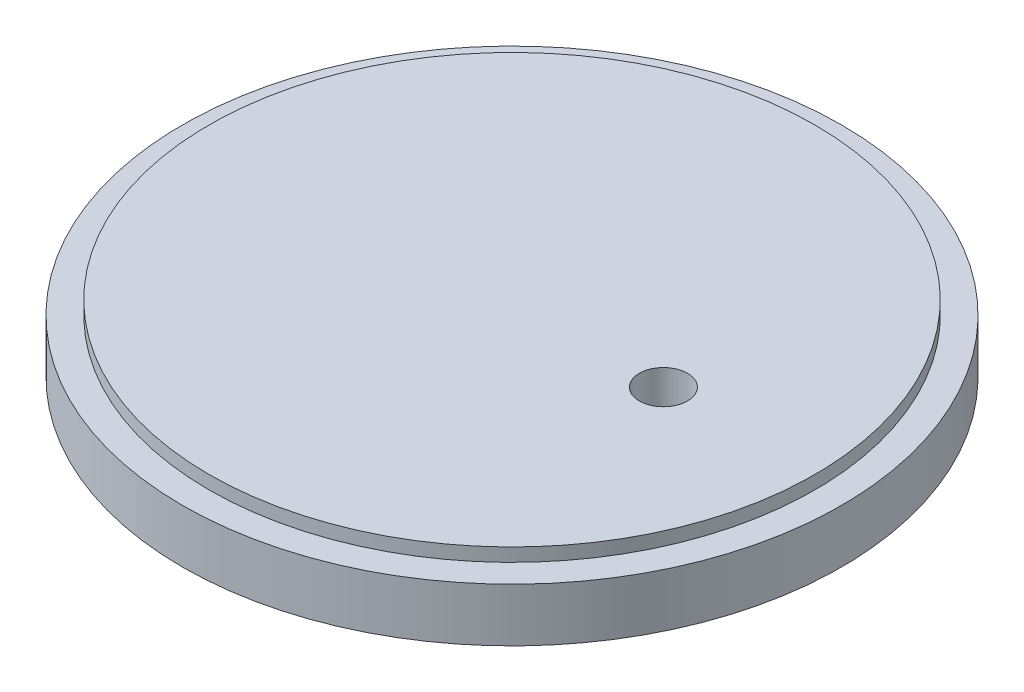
from build123d import *

# Parameters (mm, degrees)
PER_AGE1_D           = 5.4
PER_AGE1_DEPTH       = 7.5
PER_AGE1_CSINK_D     = 10
PER_AGE1_CSINK_ANGLE = 82
PER_AGE1_TIP         = 1.622323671


with BuildPart() as part:
    # Esquisse1 → R_volution1 (revolve)
    with BuildSketch(Plane.XY, mode=Mode.PRIVATE) as r_volution1_sk:
        Polygon((0, -3.75), (37, -3.75), (37, 2.25), (34, 2.25), (34, 3.75), (0, 3.75), align=None)
    revolve(r_volution1_sk.sketch.rotate(Axis((0, -57.079998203, 0), (0, 1, 0)), 90), axis=Axis((0, -57.079998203, 0), (0, 1, 0)))

    # Per_age1
    with Locations(Plane.XZ.offset(3.75)):
        with Locations((17, 0)):
            CounterSinkHole(PER_AGE1_D / 2, PER_AGE1_CSINK_D / 2, depth=PER_AGE1_DEPTH, counter_sink_angle=PER_AGE1_CSINK_ANGLE)
            with Locations((0, 0, -(PER_AGE1_DEPTH + PER_AGE1_TIP / 2))):  # 118° drill point
                Cone(0, PER_AGE1_D / 2, PER_AGE1_TIP, mode=Mode.SUBTRACT)


solid = part.part
